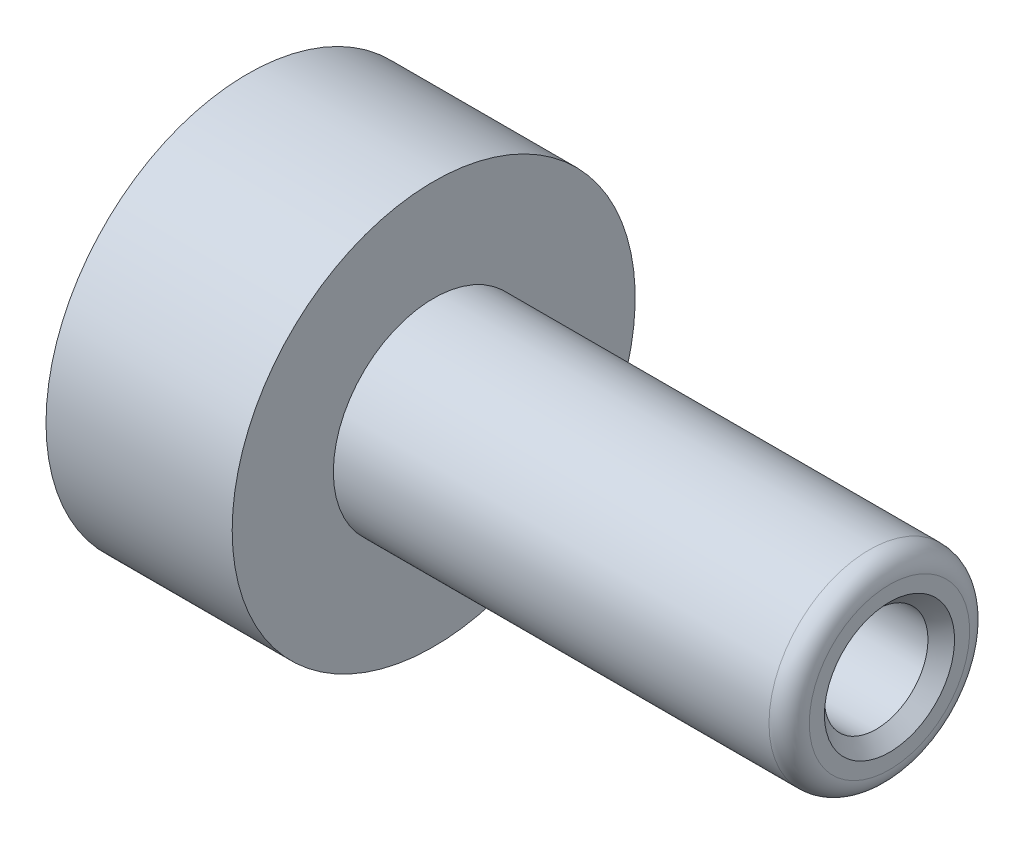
from build123d import *

# Parameters (mm, degrees)
SKETCH2_R          = 1.6129
CUT_EXTRUDE1_DEPTH = 6.35
SKETCH3_R          = 3.2639
CUT_EXTRUDE2_DEPTH = 15.7988
CHAMFER1_SIZE      = 0.8382


with BuildPart() as part:
    # Sketch1 → Revolve1 (revolve)
    with BuildSketch(Plane.XY, mode=Mode.PRIVATE) as revolve1_sk:
        with BuildLine():
            Line((0, 3.9751), (0, 12.7))
            Line((0, 12.7), (11.7348, 12.7))
            Line((11.7348, 12.7), (11.7348, 6.3246))
            Line((11.7348, 6.3246), (39.1922, 6.3246))
            ThreePointArc((39.1922, 6.3246), (40.090225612, 5.952625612), (40.4622, 5.0546))
            Line((40.4622, 5.0546), (40.4622, 0))
            Line((40.4622, 0), (21.7678, 0))
            Line((21.7678, 0), (21.7678, 3.9751))
            Line((21.7678, 3.9751), (0, 3.9751))
        make_face()
    revolve(revolve1_sk.sketch.rotate(Axis((0, 0, 0), (1, 0, 0)), 90), axis=Axis((0, 0, 0), (1, 0, 0)))

    # Sketch2 → Cut-Extrude1 (cut)
    with BuildSketch(Plane.ZY):
        with Locations((0, 7.1374)):
            Circle(SKETCH2_R)
        with Locations(Location((0, -7.1374, 0), (0, 0, 180))):
            Circle(SKETCH2_R)
    extrude(amount=-CUT_EXTRUDE1_DEPTH, mode=Mode.SUBTRACT)

    # Sketch3 → Cut-Extrude2 (cut)
    with BuildSketch(Plane(origin=(40.4622, 0, 0), x_dir=(0, 0, -1), z_dir=(1, 0, 0))):
        Circle(SKETCH3_R)
    extrude(amount=-CUT_EXTRUDE2_DEPTH, mode=Mode.SUBTRACT)

    # Chamfer1
    chamfer1_edges = [part.edges().sort_by_distance(p)[0] for p in [
        (40.4622, 0, 3.2639),
    ]]
    chamfer(chamfer1_edges, length=CHAMFER1_SIZE)


solid = part.part
